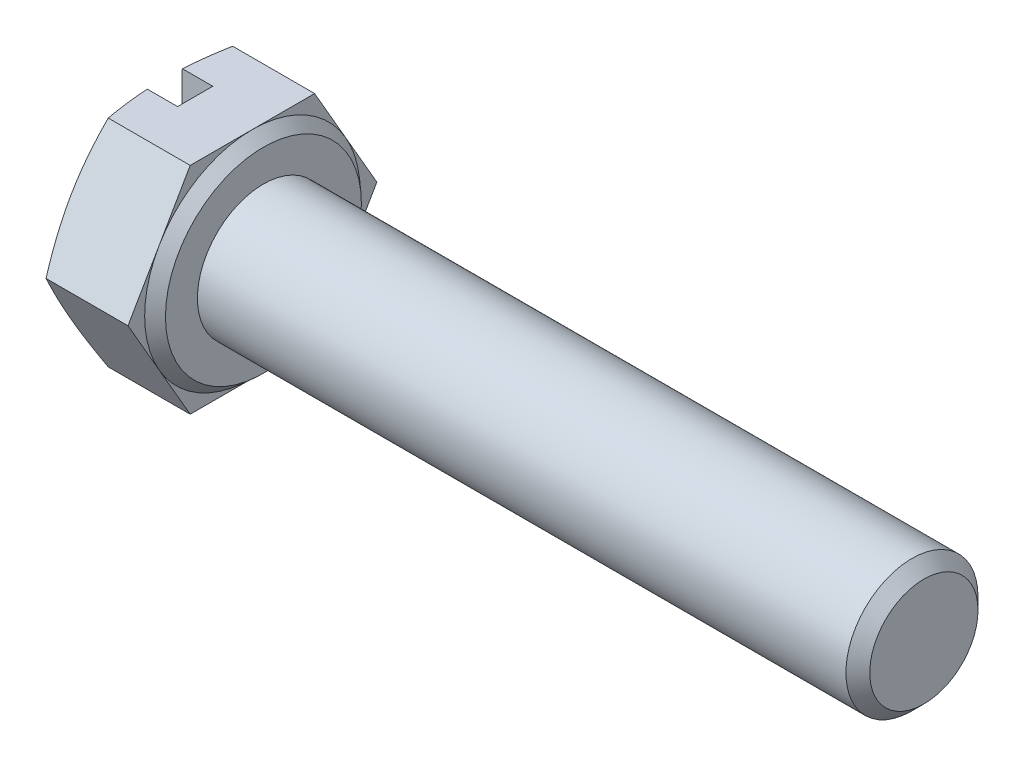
ISO-10303-21;
HEADER;
FILE_DESCRIPTION(('STEP AP214'),'2;1');
FILE_NAME('part.step','',(''),(''),'','','');
FILE_SCHEMA(('AUTOMOTIVE_DESIGN { 1 0 10303 214 1 1 1 1 }'));
ENDSEC;
DATA;
#1=APPLICATION_CONTEXT('core data for automotive mechanical design processes');
#2=APPLICATION_PROTOCOL_DEFINITION('international standard','automotive_design',2000,#1);
#3=PRODUCT_CONTEXT('',#1,'mechanical');
#4=PRODUCT('Part','Part','',(#3));
#5=PRODUCT_RELATED_PRODUCT_CATEGORY('part','',(#4));
#6=PRODUCT_DEFINITION_FORMATION('','',#4);
#7=PRODUCT_DEFINITION_CONTEXT('part definition',#1,'design');
#8=PRODUCT_DEFINITION('design','',#6,#7);
#9=PRODUCT_DEFINITION_SHAPE('','',#8);
#10=(LENGTH_UNIT() NAMED_UNIT(*) SI_UNIT(.MILLI.,.METRE.));
#11=(NAMED_UNIT(*) PLANE_ANGLE_UNIT() SI_UNIT($,.RADIAN.));
#12=(NAMED_UNIT(*) SI_UNIT($,.STERADIAN.) SOLID_ANGLE_UNIT());
#13=UNCERTAINTY_MEASURE_WITH_UNIT(LENGTH_MEASURE(1.E-05),#10,'distance_accuracy_value','');
#14=(GEOMETRIC_REPRESENTATION_CONTEXT(3) GLOBAL_UNCERTAINTY_ASSIGNED_CONTEXT((#13)) GLOBAL_UNIT_ASSIGNED_CONTEXT((#10,
#11,#12)) REPRESENTATION_CONTEXT('',''));
#15=CARTESIAN_POINT('',(0.,0.,0.));
#16=DIRECTION('',(0.,0.,1.));
#17=DIRECTION('',(1.,0.,0.));
#18=AXIS2_PLACEMENT_3D('',#15,#16,#17);
#19=CARTESIAN_POINT('',(0.,-4.89499999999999,-2.82612956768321));
#20=DIRECTION('',(1.,0.,0.));
#21=DIRECTION('',(0.,0.,-1.));
#22=AXIS2_PLACEMENT_3D('',#19,#20,#21);
#23=PLANE('',#22);
#24=CARTESIAN_POINT('',(0.,0.,0.));
#25=DIRECTION('',(1.,0.,0.));
#26=DIRECTION('',(0.,0.,-1.));
#27=AXIS2_PLACEMENT_3D('',#24,#25,#26);
#28=CIRCLE('',#27,4.895);
#29=CARTESIAN_POINT('',(0.,-4.82918471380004,-0.8));
#30=VERTEX_POINT('',#29);
#31=CARTESIAN_POINT('',(0.,-2.44749999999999,-4.23919435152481));
#32=VERTEX_POINT('',#31);
#33=EDGE_CURVE('E310',#30,#32,#28,.T.);
#34=ORIENTED_EDGE('',*,*,#33,.F.);
#35=DIRECTION('',(0.,1.,0.));
#36=VECTOR('',#35,1.);
#37=CARTESIAN_POINT('',(0.,-4.89499999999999,-0.799999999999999));
#38=LINE('',#37,#36);
#39=CARTESIAN_POINT('',(0.,4.82918471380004,-0.8));
#40=VERTEX_POINT('',#39);
#41=EDGE_CURVE('E11',#30,#40,#38,.T.);
#42=ORIENTED_EDGE('',*,*,#41,.T.);
#43=CARTESIAN_POINT('',(0.,2.4475,-4.23919435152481));
#44=VERTEX_POINT('',#43);
#45=EDGE_CURVE('E308',#44,#40,#28,.T.);
#46=ORIENTED_EDGE('',*,*,#45,.F.);
#47=EDGE_CURVE('E316',#32,#44,#28,.T.);
#48=ORIENTED_EDGE('',*,*,#47,.F.);
#49=EDGE_LOOP('',(#34,#42,#46,#48));
#50=FACE_BOUND('',#49,.T.);
#51=ADVANCED_FACE('F35',(#50),#23,.F.);
#52=CARTESIAN_POINT('',(4.,-4.89499999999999,2.82612956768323));
#53=DIRECTION('',(0.,1.,0.));
#54=DIRECTION('',(0.,0.,1.));
#55=AXIS2_PLACEMENT_3D('',#52,#53,#54);
#56=PLANE('',#55);
#57=DIRECTION('',(0.,0.,-1.));
#58=VECTOR('',#57,1.);
#59=CARTESIAN_POINT('',(1.4,-4.89500000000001,0.8));
#60=LINE('',#59,#58);
#61=CARTESIAN_POINT('',(1.4,-4.89500000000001,0.8));
#62=VERTEX_POINT('',#61);
#63=CARTESIAN_POINT('',(1.4,-4.89500000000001,-0.8));
#64=VERTEX_POINT('',#63);
#65=EDGE_CURVE('E172',#62,#64,#60,.T.);
#66=ORIENTED_EDGE('',*,*,#65,.T.);
#67=DIRECTION('',(-1.,0.,0.));
#68=VECTOR('',#67,1.);
#69=CARTESIAN_POINT('',(1.4,-4.89500000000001,-0.8));
#70=LINE('',#69,#68);
#71=CARTESIAN_POINT('',(0.0236369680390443,-4.89500000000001,-0.8));
#72=VERTEX_POINT('',#71);
#73=EDGE_CURVE('E178',#64,#72,#70,.T.);
#74=ORIENTED_EDGE('',*,*,#73,.T.);
#75=CARTESIAN_POINT('',(1.47280282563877,-4.89499999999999,-7.48259735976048));
#76=CARTESIAN_POINT('',(1.4053660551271,-4.89499999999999,-7.26112985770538));
#77=CARTESIAN_POINT('',(1.33871618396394,-4.89499999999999,-7.03941829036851));
#78=CARTESIAN_POINT('',(1.20742555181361,-4.89499999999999,-6.59538277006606));
#79=CARTESIAN_POINT('',(1.14278494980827,-4.89499999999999,-6.37305877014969));
#80=CARTESIAN_POINT('',(1.01584063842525,-4.89499999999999,-5.92729359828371));
#81=CARTESIAN_POINT('',(0.953541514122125,-4.89499999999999,-5.70385111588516));
#82=CARTESIAN_POINT('',(0.83200951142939,-4.89499999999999,-5.25613497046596));
#83=CARTESIAN_POINT('',(0.772776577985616,-4.89499999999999,-5.03186132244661));
#84=CARTESIAN_POINT('',(0.65884143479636,-4.89499999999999,-4.58509839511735));
#85=CARTESIAN_POINT('',(0.604092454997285,-4.89499999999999,-4.36262110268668));
#86=CARTESIAN_POINT('',(0.499258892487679,-4.89499999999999,-3.91657221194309));
#87=CARTESIAN_POINT('',(0.449174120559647,-4.89499999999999,-3.69300065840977));
#88=CARTESIAN_POINT('',(0.354831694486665,-4.89499999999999,-3.24469411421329));
#89=CARTESIAN_POINT('',(0.310572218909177,-4.89499999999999,-3.01995951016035));
#90=CARTESIAN_POINT('',(0.229229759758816,-4.89499999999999,-2.56918556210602));
#91=CARTESIAN_POINT('',(0.192146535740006,-4.89499999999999,-2.34314626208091));
#92=CARTESIAN_POINT('',(0.130334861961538,-4.89499999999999,-1.91521583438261));
#93=CARTESIAN_POINT('',(0.104687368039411,-4.89499999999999,-1.7134587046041));
#94=CARTESIAN_POINT('',(0.0612722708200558,-4.89499999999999,-1.30909131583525));
#95=CARTESIAN_POINT('',(0.0435044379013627,-4.89499999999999,-1.10648108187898));
#96=CARTESIAN_POINT('',(0.0167043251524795,-4.89499999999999,-0.700818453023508));
#97=CARTESIAN_POINT('',(0.00766586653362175,-4.89499999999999,-0.497766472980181));
#98=CARTESIAN_POINT('',(-0.0012178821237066,-4.89499999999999,-0.0914593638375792));
#99=CARTESIAN_POINT('',(-0.00106323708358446,-4.89499999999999,0.111795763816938));
#100=CARTESIAN_POINT('',(0.00845489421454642,-4.89499999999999,0.519118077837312));
#101=CARTESIAN_POINT('',(0.0178650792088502,-4.89499999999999,0.723184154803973));
#102=CARTESIAN_POINT('',(0.045461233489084,-4.89499999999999,1.13071691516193));
#103=CARTESIAN_POINT('',(0.0636474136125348,-4.89499999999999,1.33418358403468));
#104=CARTESIAN_POINT('',(0.107944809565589,-4.89499999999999,1.74041706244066));
#105=CARTESIAN_POINT('',(0.134062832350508,-4.89499999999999,1.94318311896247));
#106=CARTESIAN_POINT('',(0.193164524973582,-4.89499999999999,2.34770083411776));
#107=CARTESIAN_POINT('',(0.226148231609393,-4.89499999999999,2.54945248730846));
#108=CARTESIAN_POINT('',(0.299805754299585,-4.89499999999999,2.96255825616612));
#109=CARTESIAN_POINT('',(0.340794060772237,-4.89499999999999,3.17385579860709));
#110=CARTESIAN_POINT('',(0.428046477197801,-4.89499999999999,3.59536569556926));
#111=CARTESIAN_POINT('',(0.474310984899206,-4.89499999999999,3.80557796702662));
#112=CARTESIAN_POINT('',(0.571141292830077,-4.89499999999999,4.22506166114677));
#113=CARTESIAN_POINT('',(0.621708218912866,-4.89499999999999,4.43433282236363));
#114=CARTESIAN_POINT('',(0.726331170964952,-4.89499999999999,4.85200390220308));
#115=CARTESIAN_POINT('',(0.780387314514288,-4.89499999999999,5.06040379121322));
#116=CARTESIAN_POINT('',(0.946912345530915,-4.89499999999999,5.68499348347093));
#117=CARTESIAN_POINT('',(1.06361407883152,-4.89499999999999,6.10005298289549));
#118=CARTESIAN_POINT('',(1.30450839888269,-4.89499999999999,6.92789191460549));
#119=CARTESIAN_POINT('',(1.42869979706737,-4.89499999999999,7.34067169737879));
#120=CARTESIAN_POINT('',(1.68088123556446,-4.89499999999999,8.16007873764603));
#121=CARTESIAN_POINT('',(1.8088142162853,-4.89499999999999,8.56672361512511));
#122=CARTESIAN_POINT('',(2.06831294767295,-4.89499999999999,9.37886971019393));
#123=CARTESIAN_POINT('',(2.19987887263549,-4.89499999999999,9.78437087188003));
#124=CARTESIAN_POINT('',(2.46515556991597,-4.89499999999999,10.5929650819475));
#125=CARTESIAN_POINT('',(2.59885630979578,-4.89499999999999,10.9960614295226));
#126=CARTESIAN_POINT('',(2.86826241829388,-4.89499999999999,11.8015473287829));
#127=CARTESIAN_POINT('',(3.00396762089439,-4.89499999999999,12.2039369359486));
#128=CARTESIAN_POINT('',(3.14037395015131,-4.89499999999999,12.6060852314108));
#129=B_SPLINE_CURVE_WITH_KNOTS('',3,(#75,#76,#77,#78,#79,#80,#81,#82,#83,#84,#85,#86,#87,#88,
#89,#90,#91,#92,#93,#94,#95,#96,#97,#98,#99,#100,#101,#102,#103,#104,#105,#106,#107,#108,#109,
#110,#111,#112,#113,#114,#115,#116,#117,#118,#119,#120,#121,#122,#123,#124,#125,#126,#127,#128),
.UNSPECIFIED.,.F.,.F.,(4,2,2,2,2,2,2,2,2,2,2,2,2,2,2,2,2,2,2,2,2,2,2,2,2,2,4),(0.,
0.694526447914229,1.38910771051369,2.08498488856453,2.78084956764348,3.46815431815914,
4.15543117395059,4.84249262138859,5.52953104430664,6.1395393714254,6.74952992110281,
7.35908839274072,7.9686425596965,8.58128808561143,9.19394833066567,9.8071358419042,
10.4203266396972,11.0659531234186,11.7116283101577,12.3574729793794,13.0033394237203,
14.2966762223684,15.5898083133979,16.8686670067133,18.1475871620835,19.4216546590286,
20.6956172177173),.UNSPECIFIED.);
#130=CARTESIAN_POINT('',(0.275619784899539,-4.89499999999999,-2.82612956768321));
#131=VERTEX_POINT('',#130);
#132=EDGE_CURVE('E388',#131,#72,#129,.T.);
#133=ORIENTED_EDGE('',*,*,#132,.F.);
#134=DIRECTION('',(-1.,0.,0.));
#135=VECTOR('',#134,1.);
#136=CARTESIAN_POINT('',(4.,-4.89499999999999,-2.82612956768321));
#137=LINE('',#136,#135);
#138=CARTESIAN_POINT('',(4.,-4.89499999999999,-2.82612956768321));
#139=VERTEX_POINT('',#138);
#140=EDGE_CURVE('E330',#139,#131,#137,.T.);
#141=ORIENTED_EDGE('',*,*,#140,.F.);
#142=DIRECTION('',(0.,0.,-1.));
#143=VECTOR('',#142,1.);
#144=CARTESIAN_POINT('',(4.,-4.89499999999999,2.82612956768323));
#145=LINE('',#144,#143);
#146=CARTESIAN_POINT('',(4.,-4.89499999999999,0.));
#147=VERTEX_POINT('',#146);
#148=EDGE_CURVE('E371',#147,#139,#145,.T.);
#149=ORIENTED_EDGE('',*,*,#148,.F.);
#150=CARTESIAN_POINT('',(4.,-4.89499999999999,2.82612956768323));
#151=VERTEX_POINT('',#150);
#152=EDGE_CURVE('E368',#151,#147,#145,.T.);
#153=ORIENTED_EDGE('',*,*,#152,.F.);
#154=DIRECTION('',(-1.,0.,0.));
#155=VECTOR('',#154,1.);
#156=CARTESIAN_POINT('',(4.,-4.89499999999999,2.82612956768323));
#157=LINE('',#156,#155);
#158=CARTESIAN_POINT('',(0.275619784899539,-4.89500000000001,2.82612956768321));
#159=VERTEX_POINT('',#158);
#160=EDGE_CURVE('E346',#151,#159,#157,.T.);
#161=ORIENTED_EDGE('',*,*,#160,.T.);
#162=CARTESIAN_POINT('',(0.0236369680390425,-4.89500000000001,0.8));
#163=VERTEX_POINT('',#162);
#164=EDGE_CURVE('E264',#163,#159,#129,.T.);
#165=ORIENTED_EDGE('',*,*,#164,.F.);
#166=DIRECTION('',(1.,0.,0.));
#167=VECTOR('',#166,1.);
#168=CARTESIAN_POINT('',(0.,-4.89500000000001,0.8));
#169=LINE('',#168,#167);
#170=EDGE_CURVE('E181',#163,#62,#169,.T.);
#171=ORIENTED_EDGE('',*,*,#170,.T.);
#172=EDGE_LOOP('',(#66,#74,#133,#141,#149,#153,#161,#165,#171));
#173=FACE_BOUND('',#172,.T.);
#174=ADVANCED_FACE('F281',(#173),#56,.F.);
#175=CARTESIAN_POINT('',(4.,-4.89499999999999,-2.82612956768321));
#176=DIRECTION('',(0.,0.499999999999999,0.866025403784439));
#177=DIRECTION('',(0.,-0.866025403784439,0.499999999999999));
#178=AXIS2_PLACEMENT_3D('',#175,#176,#177);
#179=PLANE('',#178);
#180=CARTESIAN_POINT('',(0.275661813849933,0.000200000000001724,-5.65237460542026));
#181=CARTESIAN_POINT('',(0.233044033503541,-0.20252917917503,-5.53532885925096));
#182=CARTESIAN_POINT('',(0.194275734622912,-0.405926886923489,-5.41789713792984));
#183=CARTESIAN_POINT('',(0.126068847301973,-0.814044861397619,-5.18227011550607));
#184=CARTESIAN_POINT('',(0.096637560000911,-1.01876603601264,-5.06407429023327));
#185=CARTESIAN_POINT('',(0.0490332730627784,-1.42725892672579,-4.82823080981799));
#186=CARTESIAN_POINT('',(0.0307564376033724,-1.63102131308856,-4.71058854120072));
#187=CARTESIAN_POINT('',(0.00624205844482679,-2.03902260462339,-4.47502888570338));
#188=CARTESIAN_POINT('',(0.,-2.24326130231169,-4.3571116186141));
#189=CARTESIAN_POINT('',(0.,-2.6517386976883,-4.12127708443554));
#190=CARTESIAN_POINT('',(0.00624205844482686,-2.8559773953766,-4.00335981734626));
#191=CARTESIAN_POINT('',(0.0307564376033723,-3.26397868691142,-3.76780016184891));
#192=CARTESIAN_POINT('',(0.049033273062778,-3.4677410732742,-3.65015789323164));
#193=CARTESIAN_POINT('',(0.0966375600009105,-3.87623396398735,-3.41431441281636));
#194=CARTESIAN_POINT('',(0.126068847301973,-4.08095513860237,-3.29611858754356));
#195=CARTESIAN_POINT('',(0.194275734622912,-4.4890731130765,-3.0604915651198));
#196=CARTESIAN_POINT('',(0.233044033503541,-4.69247082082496,-2.94305984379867));
#197=CARTESIAN_POINT('',(0.275661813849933,-4.89519999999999,-2.82601409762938));
#198=B_SPLINE_CURVE_WITH_KNOTS('',3,(#180,#181,#182,#183,#184,#185,#186,#187,#188,#189,#190,
#191,#192,#193,#194,#195,#196,#197),.UNSPECIFIED.,.F.,.F.,(4,2,2,2,2,2,2,2,4),(0.,
0.713891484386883,1.42833983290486,2.13603175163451,2.84345813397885,3.55088451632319,
4.25857643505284,4.97302478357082,5.68691626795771),.UNSPECIFIED.);
#199=CARTESIAN_POINT('',(0.275619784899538,0.,-5.65225913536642));
#200=VERTEX_POINT('',#199);
#201=EDGE_CURVE('E272',#200,#32,#198,.T.);
#202=ORIENTED_EDGE('',*,*,#201,.F.);
#203=DIRECTION('',(-1.,0.,0.));
#204=VECTOR('',#203,1.);
#205=CARTESIAN_POINT('',(4.,0.,-5.65225913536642));
#206=LINE('',#205,#204);
#207=CARTESIAN_POINT('',(4.,0.,-5.65225913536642));
#208=VERTEX_POINT('',#207);
#209=EDGE_CURVE('E334',#208,#200,#206,.T.);
#210=ORIENTED_EDGE('',*,*,#209,.F.);
#211=DIRECTION('',(0.,0.866025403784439,-0.499999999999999));
#212=VECTOR('',#211,1.);
#213=CARTESIAN_POINT('',(4.,-4.89499999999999,-2.82612956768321));
#214=LINE('',#213,#212);
#215=CARTESIAN_POINT('',(4.,-2.44749999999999,-4.2391943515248));
#216=VERTEX_POINT('',#215);
#217=EDGE_CURVE('E367',#216,#208,#214,.T.);
#218=ORIENTED_EDGE('',*,*,#217,.F.);
#219=EDGE_CURVE('E364',#139,#216,#214,.T.);
#220=ORIENTED_EDGE('',*,*,#219,.F.);
#221=ORIENTED_EDGE('',*,*,#140,.T.);
#222=EDGE_CURVE('E261',#32,#131,#198,.T.);
#223=ORIENTED_EDGE('',*,*,#222,.F.);
#224=EDGE_LOOP('',(#202,#210,#218,#220,#221,#223));
#225=FACE_BOUND('',#224,.T.);
#226=ADVANCED_FACE('F278',(#225),#179,.F.);
#227=CARTESIAN_POINT('',(4.,0.,-5.65225913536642));
#228=DIRECTION('',(0.,-0.5,0.866025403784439));
#229=DIRECTION('',(0.,-0.866025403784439,-0.5));
#230=AXIS2_PLACEMENT_3D('',#227,#228,#229);
#231=PLANE('',#230);
#232=CARTESIAN_POINT('',(0.275661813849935,4.8952,-2.82601409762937));
#233=CARTESIAN_POINT('',(0.233044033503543,4.69247082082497,-2.94305984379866));
#234=CARTESIAN_POINT('',(0.194275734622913,4.48907311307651,-3.06049156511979));
#235=CARTESIAN_POINT('',(0.126068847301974,4.08095513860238,-3.29611858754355));
#236=CARTESIAN_POINT('',(0.0966375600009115,3.87623396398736,-3.41431441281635));
#237=CARTESIAN_POINT('',(0.0490332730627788,3.46774107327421,-3.65015789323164));
#238=CARTESIAN_POINT('',(0.0307564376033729,3.26397868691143,-3.7678001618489));
#239=CARTESIAN_POINT('',(0.00624205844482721,2.85597739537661,-4.00335981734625));
#240=CARTESIAN_POINT('',(0.,2.65173869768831,-4.12127708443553));
#241=CARTESIAN_POINT('',(0.,2.2432613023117,-4.35711161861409));
#242=CARTESIAN_POINT('',(0.0062420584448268,2.0390226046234,-4.47502888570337));
#243=CARTESIAN_POINT('',(0.0307564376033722,1.63102131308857,-4.71058854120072));
#244=CARTESIAN_POINT('',(0.0490332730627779,1.4272589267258,-4.82823080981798));
#245=CARTESIAN_POINT('',(0.0966375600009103,1.01876603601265,-5.06407429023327));
#246=CARTESIAN_POINT('',(0.126068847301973,0.814044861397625,-5.18227011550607));
#247=CARTESIAN_POINT('',(0.194275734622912,0.405926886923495,-5.41789713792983));
#248=CARTESIAN_POINT('',(0.233044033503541,0.202529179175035,-5.53532885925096));
#249=CARTESIAN_POINT('',(0.275661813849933,-0.000199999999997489,-5.65237460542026));
#250=B_SPLINE_CURVE_WITH_KNOTS('',3,(#232,#233,#234,#235,#236,#237,#238,#239,#240,#241,#242,
#243,#244,#245,#246,#247,#248,#249),.UNSPECIFIED.,.F.,.F.,(4,2,2,2,2,2,2,2,4),(0.,
0.713891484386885,1.42833983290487,2.13603175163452,2.84345813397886,3.5508845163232,
4.25857643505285,4.97302478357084,5.68691626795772),.UNSPECIFIED.);
#251=CARTESIAN_POINT('',(0.275619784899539,4.895,-2.82612956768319));
#252=VERTEX_POINT('',#251);
#253=EDGE_CURVE('E312',#252,#44,#250,.T.);
#254=ORIENTED_EDGE('',*,*,#253,.F.);
#255=DIRECTION('',(-1.,0.,0.));
#256=VECTOR('',#255,1.);
#257=CARTESIAN_POINT('',(4.,4.895,-2.8261295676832));
#258=LINE('',#257,#256);
#259=CARTESIAN_POINT('',(4.,4.895,-2.8261295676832));
#260=VERTEX_POINT('',#259);
#261=EDGE_CURVE('E337',#260,#252,#258,.T.);
#262=ORIENTED_EDGE('',*,*,#261,.F.);
#263=DIRECTION('',(0.,0.866025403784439,0.5));
#264=VECTOR('',#263,1.);
#265=CARTESIAN_POINT('',(4.,0.,-5.65225913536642));
#266=LINE('',#265,#264);
#267=CARTESIAN_POINT('',(4.,2.44749999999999,-4.2391943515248));
#268=VERTEX_POINT('',#267);
#269=EDGE_CURVE('E363',#268,#260,#266,.T.);
#270=ORIENTED_EDGE('',*,*,#269,.F.);
#271=EDGE_CURVE('E360',#208,#268,#266,.T.);
#272=ORIENTED_EDGE('',*,*,#271,.F.);
#273=ORIENTED_EDGE('',*,*,#209,.T.);
#274=EDGE_CURVE('E273',#44,#200,#250,.T.);
#275=ORIENTED_EDGE('',*,*,#274,.F.);
#276=EDGE_LOOP('',(#254,#262,#270,#272,#273,#275));
#277=FACE_BOUND('',#276,.T.);
#278=ADVANCED_FACE('F252',(#277),#231,.F.);
#279=CARTESIAN_POINT('',(4.,4.895,-2.8261295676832));
#280=DIRECTION('',(0.,-1.,0.));
#281=DIRECTION('',(0.,0.,-1.));
#282=AXIS2_PLACEMENT_3D('',#279,#280,#281);
#283=PLANE('',#282);
#284=CARTESIAN_POINT('',(1.47280282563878,4.895,-7.48259735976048));
#285=CARTESIAN_POINT('',(1.40536605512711,4.895,-7.26112985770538));
#286=CARTESIAN_POINT('',(1.33871618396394,4.895,-7.03941829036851));
#287=CARTESIAN_POINT('',(1.20742555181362,4.895,-6.59538277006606));
#288=CARTESIAN_POINT('',(1.14278494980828,4.895,-6.37305877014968));
#289=CARTESIAN_POINT('',(1.01584063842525,4.895,-5.9272935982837));
#290=CARTESIAN_POINT('',(0.953541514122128,4.895,-5.70385111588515));
#291=CARTESIAN_POINT('',(0.832009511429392,4.895,-5.25613497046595));
#292=CARTESIAN_POINT('',(0.772776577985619,4.895,-5.03186132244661));
#293=CARTESIAN_POINT('',(0.658841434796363,4.895,-4.58509839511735));
#294=CARTESIAN_POINT('',(0.604092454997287,4.895,-4.36262110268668));
#295=CARTESIAN_POINT('',(0.499258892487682,4.895,-3.91657221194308));
#296=CARTESIAN_POINT('',(0.44917412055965,4.895,-3.69300065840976));
#297=CARTESIAN_POINT('',(0.354831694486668,4.895,-3.24469411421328));
#298=CARTESIAN_POINT('',(0.31057221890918,4.895,-3.01995951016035));
#299=CARTESIAN_POINT('',(0.229229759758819,4.895,-2.56918556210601));
#300=CARTESIAN_POINT('',(0.19214653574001,4.895,-2.3431462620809));
#301=CARTESIAN_POINT('',(0.130334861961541,4.895,-1.9152158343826));
#302=CARTESIAN_POINT('',(0.104687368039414,4.895,-1.71345870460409));
#303=CARTESIAN_POINT('',(0.0612722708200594,4.895,-1.30909131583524));
#304=CARTESIAN_POINT('',(0.0435044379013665,4.895,-1.10648108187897));
#305=CARTESIAN_POINT('',(0.016704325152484,4.895,-0.700818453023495));
#306=CARTESIAN_POINT('',(0.0076658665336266,4.895,-0.497766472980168));
#307=CARTESIAN_POINT('',(-0.00121788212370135,4.895,-0.0914593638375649));
#308=CARTESIAN_POINT('',(-0.00106323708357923,4.895,0.111795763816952));
#309=CARTESIAN_POINT('',(0.00845489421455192,4.895,0.519118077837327));
#310=CARTESIAN_POINT('',(0.017865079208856,4.895,0.723184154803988));
#311=CARTESIAN_POINT('',(0.0454612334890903,4.895,1.13071691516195));
#312=CARTESIAN_POINT('',(0.0636474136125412,4.895,1.3341835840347));
#313=CARTESIAN_POINT('',(0.107944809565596,4.895,1.74041706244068));
#314=CARTESIAN_POINT('',(0.134062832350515,4.895,1.94318311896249));
#315=CARTESIAN_POINT('',(0.193164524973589,4.895,2.34770083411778));
#316=CARTESIAN_POINT('',(0.226148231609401,4.895,2.54945248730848));
#317=CARTESIAN_POINT('',(0.299805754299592,4.895,2.96255825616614));
#318=CARTESIAN_POINT('',(0.340794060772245,4.895,3.1738557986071));
#319=CARTESIAN_POINT('',(0.428046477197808,4.895,3.59536569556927));
#320=CARTESIAN_POINT('',(0.474310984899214,4.895,3.80557796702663));
#321=CARTESIAN_POINT('',(0.571141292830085,4.895,4.22506166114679));
#322=CARTESIAN_POINT('',(0.621708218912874,4.895,4.43433282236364));
#323=CARTESIAN_POINT('',(0.726331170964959,4.895,4.8520039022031));
#324=CARTESIAN_POINT('',(0.780387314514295,4.895,5.06040379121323));
#325=CARTESIAN_POINT('',(0.946912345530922,4.895,5.68499348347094));
#326=CARTESIAN_POINT('',(1.06361407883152,4.895,6.1000529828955));
#327=CARTESIAN_POINT('',(1.3045083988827,4.895,6.9278919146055));
#328=CARTESIAN_POINT('',(1.42869979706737,4.895,7.3406716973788));
#329=CARTESIAN_POINT('',(1.68088123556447,4.895,8.16007873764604));
#330=CARTESIAN_POINT('',(1.80881421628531,4.895,8.56672361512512));
#331=CARTESIAN_POINT('',(2.06831294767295,4.895,9.37886971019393));
#332=CARTESIAN_POINT('',(2.19987887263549,4.895,9.78437087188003));
#333=CARTESIAN_POINT('',(2.46515556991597,4.895,10.5929650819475));
#334=CARTESIAN_POINT('',(2.59885630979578,4.895,10.9960614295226));
#335=CARTESIAN_POINT('',(2.86826241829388,4.895,11.8015473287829));
#336=CARTESIAN_POINT('',(3.00396762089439,4.895,12.2039369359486));
#337=CARTESIAN_POINT('',(3.14037395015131,4.895,12.6060852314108));
#338=B_SPLINE_CURVE_WITH_KNOTS('',3,(#284,#285,#286,#287,#288,#289,#290,#291,#292,#293,#294,
#295,#296,#297,#298,#299,#300,#301,#302,#303,#304,#305,#306,#307,#308,#309,#310,#311,#312,#313,
#314,#315,#316,#317,#318,#319,#320,#321,#322,#323,#324,#325,#326,#327,#328,#329,#330,#331,#332,
#333,#334,#335,#336,#337),.UNSPECIFIED.,.F.,.F.,(4,2,2,2,2,2,2,2,2,2,2,2,2,2,2,2,2,2,2,2,2,2,2,
2,2,2,4),(0.,0.694526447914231,1.38910771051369,2.08498488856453,2.78084956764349,
3.46815431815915,4.15543117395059,4.84249262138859,5.52953104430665,6.13953937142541,
6.74952992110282,7.35908839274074,7.96864255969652,8.58128808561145,9.19394833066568,
9.80713584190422,10.4203266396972,11.0659531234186,11.7116283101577,12.3574729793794,
13.0033394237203,14.2966762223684,15.5898083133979,16.8686670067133,18.1475871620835,
19.4216546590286,20.6956172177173),.UNSPECIFIED.);
#339=CARTESIAN_POINT('',(0.0236369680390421,4.895,-0.8));
#340=VERTEX_POINT('',#339);
#341=EDGE_CURVE('E263',#340,#252,#338,.F.);
#342=ORIENTED_EDGE('',*,*,#341,.F.);
#343=DIRECTION('',(-1.,0.,0.));
#344=VECTOR('',#343,1.);
#345=CARTESIAN_POINT('',(1.4,4.895,-0.8));
#346=LINE('',#345,#344);
#347=CARTESIAN_POINT('',(1.4,4.895,-0.8));
#348=VERTEX_POINT('',#347);
#349=EDGE_CURVE('E165',#348,#340,#346,.T.);
#350=ORIENTED_EDGE('',*,*,#349,.F.);
#351=DIRECTION('',(0.,0.,-1.));
#352=VECTOR('',#351,1.);
#353=CARTESIAN_POINT('',(1.4,4.895,0.8));
#354=LINE('',#353,#352);
#355=CARTESIAN_POINT('',(1.4,4.895,0.8));
#356=VERTEX_POINT('',#355);
#357=EDGE_CURVE('E164',#356,#348,#354,.T.);
#358=ORIENTED_EDGE('',*,*,#357,.F.);
#359=DIRECTION('',(1.,0.,0.));
#360=VECTOR('',#359,1.);
#361=CARTESIAN_POINT('',(0.,4.895,0.8));
#362=LINE('',#361,#360);
#363=CARTESIAN_POINT('',(0.0236369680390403,4.895,0.8));
#364=VERTEX_POINT('',#363);
#365=EDGE_CURVE('E153',#364,#356,#362,.T.);
#366=ORIENTED_EDGE('',*,*,#365,.F.);
#367=CARTESIAN_POINT('',(0.275619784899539,4.895,2.82612956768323));
#368=VERTEX_POINT('',#367);
#369=EDGE_CURVE('E256',#368,#364,#338,.F.);
#370=ORIENTED_EDGE('',*,*,#369,.F.);
#371=DIRECTION('',(-1.,0.,0.));
#372=VECTOR('',#371,1.);
#373=CARTESIAN_POINT('',(4.,4.895,2.82612956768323));
#374=LINE('',#373,#372);
#375=CARTESIAN_POINT('',(4.,4.895,2.82612956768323));
#376=VERTEX_POINT('',#375);
#377=EDGE_CURVE('E340',#376,#368,#374,.T.);
#378=ORIENTED_EDGE('',*,*,#377,.F.);
#379=DIRECTION('',(0.,0.,1.));
#380=VECTOR('',#379,1.);
#381=CARTESIAN_POINT('',(4.,4.895,-2.8261295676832));
#382=LINE('',#381,#380);
#383=CARTESIAN_POINT('',(4.,4.89499999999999,0.));
#384=VERTEX_POINT('',#383);
#385=EDGE_CURVE('E359',#384,#376,#382,.T.);
#386=ORIENTED_EDGE('',*,*,#385,.F.);
#387=EDGE_CURVE('E356',#260,#384,#382,.T.);
#388=ORIENTED_EDGE('',*,*,#387,.F.);
#389=ORIENTED_EDGE('',*,*,#261,.T.);
#390=EDGE_LOOP('',(#342,#350,#358,#366,#370,#378,#386,#388,#389));
#391=FACE_BOUND('',#390,.T.);
#392=ADVANCED_FACE('F177',(#391),#283,.F.);
#393=CARTESIAN_POINT('',(4.,4.895,2.82612956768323));
#394=DIRECTION('',(0.,-0.499999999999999,-0.866025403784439));
#395=DIRECTION('',(0.,0.866025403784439,-0.499999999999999));
#396=AXIS2_PLACEMENT_3D('',#393,#394,#395);
#397=PLANE('',#396);
#398=CARTESIAN_POINT('',(0.27566181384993,-0.000199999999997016,5.65237460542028));
#399=CARTESIAN_POINT('',(0.233044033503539,0.202529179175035,5.53532885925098));
#400=CARTESIAN_POINT('',(0.194275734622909,0.405926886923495,5.41789713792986));
#401=CARTESIAN_POINT('',(0.12606884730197,0.814044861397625,5.18227011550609));
#402=CARTESIAN_POINT('',(0.0966375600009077,1.01876603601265,5.06407429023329));
#403=CARTESIAN_POINT('',(0.0490332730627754,1.4272589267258,4.82823080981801));
#404=CARTESIAN_POINT('',(0.0307564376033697,1.63102131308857,4.71058854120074));
#405=CARTESIAN_POINT('',(0.00624205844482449,2.03902260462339,4.4750288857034));
#406=CARTESIAN_POINT('',(0.,2.2432613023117,4.35711161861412));
#407=CARTESIAN_POINT('',(0.,2.65173869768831,4.12127708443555));
#408=CARTESIAN_POINT('',(0.00624205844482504,2.85597739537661,4.00335981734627));
#409=CARTESIAN_POINT('',(0.0307564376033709,3.26397868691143,3.76780016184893));
#410=CARTESIAN_POINT('',(0.049033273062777,3.46774107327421,3.65015789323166));
#411=CARTESIAN_POINT('',(0.09663756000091,3.87623396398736,3.41431441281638));
#412=CARTESIAN_POINT('',(0.126068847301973,4.08095513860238,3.29611858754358));
#413=CARTESIAN_POINT('',(0.194275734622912,4.48907311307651,3.06049156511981));
#414=CARTESIAN_POINT('',(0.233044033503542,4.69247082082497,2.94305984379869));
#415=CARTESIAN_POINT('',(0.275661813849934,4.8952,2.82601409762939));
#416=B_SPLINE_CURVE_WITH_KNOTS('',3,(#398,#399,#400,#401,#402,#403,#404,#405,#406,#407,#408,
#409,#410,#411,#412,#413,#414,#415),.UNSPECIFIED.,.F.,.F.,(4,2,2,2,2,2,2,2,4),(0.,
0.713891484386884,1.42833983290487,2.13603175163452,2.84345813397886,3.5508845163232,
4.25857643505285,4.97302478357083,5.68691626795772),.UNSPECIFIED.);
#417=CARTESIAN_POINT('',(0.27561978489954,0.,5.65225913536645));
#418=VERTEX_POINT('',#417);
#419=CARTESIAN_POINT('',(0.,2.4475,4.23919435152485));
#420=VERTEX_POINT('',#419);
#421=EDGE_CURVE('E58',#418,#420,#416,.T.);
#422=ORIENTED_EDGE('',*,*,#421,.F.);
#423=DIRECTION('',(-1.,0.,0.));
#424=VECTOR('',#423,1.);
#425=CARTESIAN_POINT('',(4.,0.,5.65225913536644));
#426=LINE('',#425,#424);
#427=CARTESIAN_POINT('',(4.,0.,5.65225913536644));
#428=VERTEX_POINT('',#427);
#429=EDGE_CURVE('E343',#428,#418,#426,.T.);
#430=ORIENTED_EDGE('',*,*,#429,.F.);
#431=DIRECTION('',(0.,-0.866025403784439,0.499999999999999));
#432=VECTOR('',#431,1.);
#433=CARTESIAN_POINT('',(4.,4.895,2.82612956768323));
#434=LINE('',#433,#432);
#435=CARTESIAN_POINT('',(4.,2.44749999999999,4.23919435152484));
#436=VERTEX_POINT('',#435);
#437=EDGE_CURVE('E355',#436,#428,#434,.T.);
#438=ORIENTED_EDGE('',*,*,#437,.F.);
#439=EDGE_CURVE('E352',#376,#436,#434,.T.);
#440=ORIENTED_EDGE('',*,*,#439,.F.);
#441=ORIENTED_EDGE('',*,*,#377,.T.);
#442=EDGE_CURVE('E262',#420,#368,#416,.T.);
#443=ORIENTED_EDGE('',*,*,#442,.F.);
#444=EDGE_LOOP('',(#422,#430,#438,#440,#441,#443));
#445=FACE_BOUND('',#444,.T.);
#446=ADVANCED_FACE('F242',(#445),#397,.F.);
#447=CARTESIAN_POINT('',(4.,0.,5.65225913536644));
#448=DIRECTION('',(0.,0.5,-0.866025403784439));
#449=DIRECTION('',(0.,0.866025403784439,0.5));
#450=AXIS2_PLACEMENT_3D('',#447,#448,#449);
#451=PLANE('',#450);
#452=CARTESIAN_POINT('',(0.27566181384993,-4.89519999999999,2.82601409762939));
#453=CARTESIAN_POINT('',(0.233044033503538,-4.69247082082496,2.94305984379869));
#454=CARTESIAN_POINT('',(0.194275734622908,-4.4890731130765,3.06049156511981));
#455=CARTESIAN_POINT('',(0.126068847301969,-4.08095513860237,3.29611858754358));
#456=CARTESIAN_POINT('',(0.0966375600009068,-3.87623396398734,3.41431441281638));
#457=CARTESIAN_POINT('',(0.0490332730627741,-3.4677410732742,3.65015789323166));
#458=CARTESIAN_POINT('',(0.0307564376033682,-3.26397868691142,3.76780016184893));
#459=CARTESIAN_POINT('',(0.00624205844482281,-2.8559773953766,4.00335981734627));
#460=CARTESIAN_POINT('',(0.,-2.6517386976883,4.12127708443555));
#461=CARTESIAN_POINT('',(0.,-2.24326130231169,4.35711161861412));
#462=CARTESIAN_POINT('',(0.00624205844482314,-2.03902260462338,4.4750288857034));
#463=CARTESIAN_POINT('',(0.0307564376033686,-1.63102131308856,4.71058854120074));
#464=CARTESIAN_POINT('',(0.0490332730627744,-1.42725892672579,4.82823080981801));
#465=CARTESIAN_POINT('',(0.0966375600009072,-1.01876603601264,5.06407429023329));
#466=CARTESIAN_POINT('',(0.12606884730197,-0.814044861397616,5.18227011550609));
#467=CARTESIAN_POINT('',(0.194275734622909,-0.405926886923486,5.41789713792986));
#468=CARTESIAN_POINT('',(0.233044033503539,-0.202529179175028,5.53532885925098));
#469=CARTESIAN_POINT('',(0.275661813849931,0.000200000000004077,5.65237460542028));
#470=B_SPLINE_CURVE_WITH_KNOTS('',3,(#452,#453,#454,#455,#456,#457,#458,#459,#460,#461,#462,
#463,#464,#465,#466,#467,#468,#469),.UNSPECIFIED.,.F.,.F.,(4,2,2,2,2,2,2,2,4),(0.,
0.713891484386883,1.42833983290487,2.13603175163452,2.84345813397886,3.5508845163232,
4.25857643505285,4.97302478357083,5.68691626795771),.UNSPECIFIED.);
#471=CARTESIAN_POINT('',(0.,-2.44749999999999,4.23919435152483));
#472=VERTEX_POINT('',#471);
#473=EDGE_CURVE('E231',#159,#472,#470,.T.);
#474=ORIENTED_EDGE('',*,*,#473,.F.);
#475=ORIENTED_EDGE('',*,*,#160,.F.);
#476=DIRECTION('',(0.,-0.866025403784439,-0.5));
#477=VECTOR('',#476,1.);
#478=CARTESIAN_POINT('',(4.,0.,5.65225913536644));
#479=LINE('',#478,#477);
#480=CARTESIAN_POINT('',(4.,-2.44749999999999,4.23919435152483));
#481=VERTEX_POINT('',#480);
#482=EDGE_CURVE('E351',#481,#151,#479,.T.);
#483=ORIENTED_EDGE('',*,*,#482,.F.);
#484=EDGE_CURVE('E348',#428,#481,#479,.T.);
#485=ORIENTED_EDGE('',*,*,#484,.F.);
#486=ORIENTED_EDGE('',*,*,#429,.T.);
#487=EDGE_CURVE('E225',#472,#418,#470,.T.);
#488=ORIENTED_EDGE('',*,*,#487,.F.);
#489=EDGE_LOOP('',(#474,#475,#483,#485,#486,#488));
#490=FACE_BOUND('',#489,.T.);
#491=ADVANCED_FACE('F237',(#490),#451,.F.);
#492=CARTESIAN_POINT('',(4.5,0.,0.));
#493=DIRECTION('',(1.,0.,0.));
#494=DIRECTION('',(0.,0.,-1.));
#495=AXIS2_PLACEMENT_3D('',#492,#493,#494);
#496=PLANE('',#495);
#497=CARTESIAN_POINT('',(4.5,0.,0.));
#498=DIRECTION('',(-1.,0.,0.));
#499=DIRECTION('',(0.,0.,1.));
#500=AXIS2_PLACEMENT_3D('',#497,#498,#499);
#501=CIRCLE('',#500,4.45);
#502=CARTESIAN_POINT('',(4.5,0.,4.45000000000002));
#503=VERTEX_POINT('',#502);
#504=EDGE_CURVE('E372',#503,#503,#501,.T.);
#505=ORIENTED_EDGE('',*,*,#504,.F.);
#506=EDGE_LOOP('',(#505));
#507=FACE_BOUND('',#506,.T.);
#508=CARTESIAN_POINT('',(4.5,0.,0.));
#509=DIRECTION('',(1.,0.,0.));
#510=DIRECTION('',(0.,0.,-1.));
#511=AXIS2_PLACEMENT_3D('',#508,#509,#510);
#512=CIRCLE('',#511,3.);
#513=CARTESIAN_POINT('',(4.5,0.,-3.));
#514=VERTEX_POINT('',#513);
#515=EDGE_CURVE('E377',#514,#514,#512,.T.);
#516=ORIENTED_EDGE('',*,*,#515,.F.);
#517=EDGE_LOOP('',(#516));
#518=FACE_BOUND('',#517,.T.);
#519=ADVANCED_FACE('F241',(#507,#518),#496,.T.);
#520=CARTESIAN_POINT('',(4.,-4.89499999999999,-2.82612956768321));
#521=DIRECTION('',(1.,0.,0.));
#522=DIRECTION('',(0.,0.,-1.));
#523=AXIS2_PLACEMENT_3D('',#520,#521,#522);
#524=PLANE('',#523);
#525=ORIENTED_EDGE('',*,*,#439,.T.);
#526=CARTESIAN_POINT('',(4.,0.,0.));
#527=DIRECTION('',(-1.,0.,0.));
#528=DIRECTION('',(0.,0.,1.));
#529=AXIS2_PLACEMENT_3D('',#526,#527,#528);
#530=CIRCLE('',#529,4.89499999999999);
#531=EDGE_CURVE('E375',#436,#384,#530,.T.);
#532=ORIENTED_EDGE('',*,*,#531,.T.);
#533=ORIENTED_EDGE('',*,*,#385,.T.);
#534=EDGE_LOOP('',(#525,#532,#533));
#535=FACE_BOUND('',#534,.T.);
#536=ADVANCED_FACE('F405',(#535),#524,.T.);
#537=ORIENTED_EDGE('',*,*,#387,.T.);
#538=EDGE_CURVE('E327',#384,#268,#530,.T.);
#539=ORIENTED_EDGE('',*,*,#538,.T.);
#540=ORIENTED_EDGE('',*,*,#269,.T.);
#541=EDGE_LOOP('',(#537,#539,#540));
#542=FACE_BOUND('',#541,.T.);
#543=ADVANCED_FACE('F425',(#542),#524,.T.);
#544=ORIENTED_EDGE('',*,*,#271,.T.);
#545=EDGE_CURVE('E418',#268,#216,#530,.T.);
#546=ORIENTED_EDGE('',*,*,#545,.T.);
#547=ORIENTED_EDGE('',*,*,#217,.T.);
#548=EDGE_LOOP('',(#544,#546,#547));
#549=FACE_BOUND('',#548,.T.);
#550=ADVANCED_FACE('F429',(#549),#524,.T.);
#551=ORIENTED_EDGE('',*,*,#219,.T.);
#552=EDGE_CURVE('E414',#216,#147,#530,.T.);
#553=ORIENTED_EDGE('',*,*,#552,.T.);
#554=ORIENTED_EDGE('',*,*,#148,.T.);
#555=EDGE_LOOP('',(#551,#553,#554));
#556=FACE_BOUND('',#555,.T.);
#557=ADVANCED_FACE('F430',(#556),#524,.T.);
#558=ORIENTED_EDGE('',*,*,#152,.T.);
#559=EDGE_CURVE('E413',#147,#481,#530,.T.);
#560=ORIENTED_EDGE('',*,*,#559,.T.);
#561=ORIENTED_EDGE('',*,*,#482,.T.);
#562=EDGE_LOOP('',(#558,#560,#561));
#563=FACE_BOUND('',#562,.T.);
#564=ADVANCED_FACE('F432',(#563),#524,.T.);
#565=ORIENTED_EDGE('',*,*,#484,.T.);
#566=EDGE_CURVE('E333',#481,#436,#530,.T.);
#567=ORIENTED_EDGE('',*,*,#566,.T.);
#568=ORIENTED_EDGE('',*,*,#437,.T.);
#569=EDGE_LOOP('',(#565,#567,#568));
#570=FACE_BOUND('',#569,.T.);
#571=ADVANCED_FACE('F412',(#570),#524,.T.);
#572=CARTESIAN_POINT('',(4.,0.,0.));
#573=DIRECTION('',(-1.,0.,0.));
#574=DIRECTION('',(0.,0.,1.));
#575=AXIS2_PLACEMENT_3D('',#572,#573,#574);
#576=CONICAL_SURFACE('',#575,4.89499999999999,0.727262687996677);
#577=ORIENTED_EDGE('',*,*,#504,.T.);
#578=EDGE_LOOP('',(#577));
#579=FACE_BOUND('',#578,.T.);
#580=ORIENTED_EDGE('',*,*,#531,.F.);
#581=ORIENTED_EDGE('',*,*,#566,.F.);
#582=ORIENTED_EDGE('',*,*,#559,.F.);
#583=ORIENTED_EDGE('',*,*,#552,.F.);
#584=ORIENTED_EDGE('',*,*,#545,.F.);
#585=ORIENTED_EDGE('',*,*,#538,.F.);
#586=EDGE_LOOP('',(#580,#581,#582,#583,#584,#585));
#587=FACE_BOUND('',#586,.T.);
#588=ADVANCED_FACE('F408',(#579,#587),#576,.T.);
#589=CARTESIAN_POINT('',(34.5,0.,0.));
#590=DIRECTION('',(-1.,0.,0.));
#591=DIRECTION('',(0.,0.,1.));
#592=AXIS2_PLACEMENT_3D('',#589,#590,#591);
#593=CYLINDRICAL_SURFACE('',#592,3.);
#594=CARTESIAN_POINT('',(33.9585,0.,0.));
#595=DIRECTION('',(1.,0.,0.));
#596=DIRECTION('',(0.,0.,-1.));
#597=AXIS2_PLACEMENT_3D('',#594,#595,#596);
#598=CIRCLE('',#597,3.);
#599=CARTESIAN_POINT('',(33.9585,0.,-3.));
#600=VERTEX_POINT('',#599);
#601=EDGE_CURVE('E320',#600,#600,#598,.F.);
#602=ORIENTED_EDGE('',*,*,#601,.T.);
#603=EDGE_LOOP('',(#602));
#604=FACE_BOUND('',#603,.T.);
#605=ORIENTED_EDGE('',*,*,#515,.T.);
#606=EDGE_LOOP('',(#605));
#607=FACE_BOUND('',#606,.T.);
#608=ADVANCED_FACE('F445',(#604,#607),#593,.T.);
#609=CARTESIAN_POINT('',(34.5,0.,0.));
#610=DIRECTION('',(1.,0.,0.));
#611=DIRECTION('',(0.,0.,-1.));
#612=AXIS2_PLACEMENT_3D('',#609,#610,#611);
#613=PLANE('',#612);
#614=CARTESIAN_POINT('',(34.5,0.,0.));
#615=DIRECTION('',(1.,0.,0.));
#616=DIRECTION('',(0.,0.,-1.));
#617=AXIS2_PLACEMENT_3D('',#614,#615,#616);
#618=CIRCLE('',#617,2.4585);
#619=CARTESIAN_POINT('',(34.5,0.,-2.4585));
#620=VERTEX_POINT('',#619);
#621=EDGE_CURVE('E323',#620,#620,#618,.T.);
#622=ORIENTED_EDGE('',*,*,#621,.T.);
#623=EDGE_LOOP('',(#622));
#624=FACE_BOUND('',#623,.T.);
#625=ADVANCED_FACE('F448',(#624),#613,.T.);
#626=CARTESIAN_POINT('',(34.5,0.,0.));
#627=DIRECTION('',(-1.,0.,0.));
#628=DIRECTION('',(0.,0.,1.));
#629=AXIS2_PLACEMENT_3D('',#626,#627,#628);
#630=CONICAL_SURFACE('',#629,2.4585,0.785398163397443);
#631=ORIENTED_EDGE('',*,*,#601,.F.);
#632=EDGE_LOOP('',(#631));
#633=FACE_BOUND('',#632,.T.);
#634=ORIENTED_EDGE('',*,*,#621,.F.);
#635=EDGE_LOOP('',(#634));
#636=FACE_BOUND('',#635,.T.);
#637=ADVANCED_FACE('F37',(#633,#636),#630,.T.);
#638=CARTESIAN_POINT('',(0.,0.,0.));
#639=DIRECTION('',(1.,0.,0.));
#640=DIRECTION('',(0.,0.,-1.));
#641=AXIS2_PLACEMENT_3D('',#638,#639,#640);
#642=CONICAL_SURFACE('',#641,4.895,1.22173047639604);
#643=ORIENTED_EDGE('',*,*,#274,.T.);
#644=ORIENTED_EDGE('',*,*,#201,.T.);
#645=ORIENTED_EDGE('',*,*,#47,.T.);
#646=EDGE_LOOP('',(#643,#644,#645));
#647=FACE_BOUND('',#646,.T.);
#648=ADVANCED_FACE('F382',(#647),#642,.T.);
#649=CARTESIAN_POINT('',(-1.45629293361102,-0.398748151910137,-0.8));
#650=CARTESIAN_POINT('',(-1.45009469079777,-0.436899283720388,-0.8));
#651=CARTESIAN_POINT('',(-1.44321178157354,-0.474930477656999,-0.8));
#652=CARTESIAN_POINT('',(-1.42831794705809,-0.550759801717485,-0.8));
#653=CARTESIAN_POINT('',(-1.42030738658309,-0.588558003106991,-0.8));
#654=CARTESIAN_POINT('',(-1.3949572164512,-0.701569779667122,-0.8));
#655=CARTESIAN_POINT('',(-1.37628488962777,-0.776481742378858,-0.8));
#656=CARTESIAN_POINT('',(-1.33673286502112,-0.92560702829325,-0.8));
#657=CARTESIAN_POINT('',(-1.31585589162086,-0.999821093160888,-0.8));
#658=CARTESIAN_POINT('',(-1.27264573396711,-1.14784942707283,-0.8));
#659=CARTESIAN_POINT('',(-1.25031204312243,-1.22166354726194,-0.8));
#660=CARTESIAN_POINT('',(-1.18365997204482,-1.43694631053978,-0.8));
#661=CARTESIAN_POINT('',(-1.13806486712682,-1.57801695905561,-0.8));
#662=CARTESIAN_POINT('',(-1.04513213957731,-1.85958490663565,-0.8));
#663=CARTESIAN_POINT('',(-0.997794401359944,-2.00008216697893,-0.8));
#664=CARTESIAN_POINT('',(-0.902111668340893,-2.28073153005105,-0.8));
#665=CARTESIAN_POINT('',(-0.853766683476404,-2.42088363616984,-0.8));
#666=CARTESIAN_POINT('',(-0.756457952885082,-2.70096728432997,-0.8));
#667=CARTESIAN_POINT('',(-0.707494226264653,-2.84089883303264,-0.8));
#668=CARTESIAN_POINT('',(-0.559802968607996,-3.26106164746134,-0.8));
#669=CARTESIAN_POINT('',(-0.460475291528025,-3.54108177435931,-0.8));
#670=CARTESIAN_POINT('',(-0.261053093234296,-4.10083448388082,-0.8));
#671=CARTESIAN_POINT('',(-0.16095860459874,-4.38056707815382,-0.8));
#672=CARTESIAN_POINT('',(0.0656659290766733,-5.0123284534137,-0.8));
#673=CARTESIAN_POINT('',(0.192326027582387,-5.36431058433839,-0.8));
#674=CARTESIAN_POINT('',(0.446031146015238,-6.06814229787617,-0.8));
#675=CARTESIAN_POINT('',(0.573076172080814,-6.41999187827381,-0.8));
#676=CARTESIAN_POINT('',(0.827032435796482,-7.12258572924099,-0.8));
#677=CARTESIAN_POINT('',(0.953942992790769,-7.47333024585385,-0.8));
#678=CARTESIAN_POINT('',(1.20792094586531,-8.17475565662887,-0.8));
#679=CARTESIAN_POINT('',(1.33498833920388,-8.52543655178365,-0.8));
#680=CARTESIAN_POINT('',(1.46209792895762,-8.87610210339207,-0.8));
#681=B_SPLINE_CURVE_WITH_KNOTS('',3,(#649,#650,#651,#652,#653,#654,#655,#656,#657,#658,#659,
#660,#661,#662,#663,#664,#665,#666,#667,#668,#669,#670,#671,#672,#673,#674,#675,#676,#677,#678,
#679,#680),.UNSPECIFIED.,.F.,.F.,(4,2,2,2,2,2,2,2,2,2,2,2,2,2,2,4),(0.,0.11593519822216,
0.231832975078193,0.46338148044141,0.694647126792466,0.925993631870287,1.37073370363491,
1.81550332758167,2.26026856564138,2.70502010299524,3.59636165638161,4.48766554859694,
5.60989839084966,6.73214922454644,7.85114517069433,8.9701218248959),.UNSPECIFIED.);
#682=EDGE_CURVE('E217',#30,#72,#681,.T.);
#683=ORIENTED_EDGE('',*,*,#682,.F.);
#684=ORIENTED_EDGE('',*,*,#33,.T.);
#685=ORIENTED_EDGE('',*,*,#222,.T.);
#686=ORIENTED_EDGE('',*,*,#132,.T.);
#687=EDGE_LOOP('',(#683,#684,#685,#686));
#688=FACE_BOUND('',#687,.T.);
#689=ADVANCED_FACE('F387',(#688),#642,.T.);
#690=CARTESIAN_POINT('',(1.46209792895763,-8.87610210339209,0.8));
#691=CARTESIAN_POINT('',(1.33478158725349,-8.52486807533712,0.8));
#692=CARTESIAN_POINT('',(1.20750850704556,-8.17361833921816,0.8));
#693=CARTESIAN_POINT('',(0.953133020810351,-7.47109150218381,0.8));
#694=CARTESIAN_POINT('',(0.826030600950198,-7.11981440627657,0.8));
#695=CARTESIAN_POINT('',(0.572087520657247,-6.41725633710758,0.8));
#696=CARTESIAN_POINT('',(0.445246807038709,-6.06597538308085,0.8));
#697=CARTESIAN_POINT('',(0.255273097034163,-5.53893453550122,0.8));
#698=CARTESIAN_POINT('',(0.191993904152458,-5.36322734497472,0.8));
#699=CARTESIAN_POINT('',(0.0655660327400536,-5.0117641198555,0.8));
#700=CARTESIAN_POINT('',(0.00241735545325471,-4.8360080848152,0.8));
#701=CARTESIAN_POINT('',(-0.123730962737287,-4.48434887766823,0.8));
#702=CARTESIAN_POINT('',(-0.186730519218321,-4.3084456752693,0.8));
#703=CARTESIAN_POINT('',(-0.312474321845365,-3.95655478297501,0.8));
#704=CARTESIAN_POINT('',(-0.375218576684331,-3.78056709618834,0.8));
#705=CARTESIAN_POINT('',(-0.500314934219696,-3.42850454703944,0.8));
#706=CARTESIAN_POINT('',(-0.562667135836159,-3.25242971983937,0.8));
#707=CARTESIAN_POINT('',(-0.686797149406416,-2.90005265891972,0.8));
#708=CARTESIAN_POINT('',(-0.748574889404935,-2.72375039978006,0.8));
#709=CARTESIAN_POINT('',(-0.840521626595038,-2.45895448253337,0.8));
#710=CARTESIAN_POINT('',(-0.871064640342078,-2.37059078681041,0.8));
#711=CARTESIAN_POINT('',(-0.931807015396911,-2.19374830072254,0.8));
#712=CARTESIAN_POINT('',(-0.962006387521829,-2.1052695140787,0.8));
#713=CARTESIAN_POINT('',(-1.02191785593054,-1.92818668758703,0.8));
#714=CARTESIAN_POINT('',(-1.05163014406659,-1.83958271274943,0.8));
#715=CARTESIAN_POINT('',(-1.11037472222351,-1.662137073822,0.8));
#716=CARTESIAN_POINT('',(-1.13940693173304,-1.57329538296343,0.8));
#717=CARTESIAN_POINT('',(-1.19648350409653,-1.39515385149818,0.8));
#718=CARTESIAN_POINT('',(-1.22452639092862,-1.30585353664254,0.8));
#719=CARTESIAN_POINT('',(-1.27898741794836,-1.12678275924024,0.8));
#720=CARTESIAN_POINT('',(-1.30540608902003,-1.03701246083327,0.8));
#721=CARTESIAN_POINT('',(-1.34301539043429,-0.901715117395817,0.8));
#722=CARTESIAN_POINT('',(-1.35522435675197,-0.856472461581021,0.8));
#723=CARTESIAN_POINT('',(-1.37873284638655,-0.765756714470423,0.8));
#724=CARTESIAN_POINT('',(-1.39003249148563,-0.720283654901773,0.8));
#725=CARTESIAN_POINT('',(-1.41145329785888,-0.629001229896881,0.8));
#726=CARTESIAN_POINT('',(-1.42157310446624,-0.583191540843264,0.8));
#727=CARTESIAN_POINT('',(-1.44022542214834,-0.491230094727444,0.8));
#728=CARTESIAN_POINT('',(-1.44875718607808,-0.445078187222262,0.8));
#729=CARTESIAN_POINT('',(-1.45629293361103,-0.398748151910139,0.8));
#730=B_SPLINE_CURVE_WITH_KNOTS('',3,(#690,#691,#692,#693,#694,#695,#696,#697,#698,#699,#700,
#701,#702,#703,#704,#705,#706,#707,#708,#709,#710,#711,#712,#713,#714,#715,#716,#717,#718,#719,
#720,#721,#722,#723,#724,#725,#726,#727,#728,#729),.UNSPECIFIED.,.F.,.F.,(4,2,2,2,2,2,2,2,2,2,2,
2,2,2,2,2,2,2,2,4),(0.,1.12079133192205,2.24148555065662,3.36192363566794,3.92218733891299,
4.48245635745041,5.04298984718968,5.60350408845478,6.16387072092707,6.72430662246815,
7.0047863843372,7.28525729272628,7.56561493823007,7.84600560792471,8.12679829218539,
8.40749870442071,8.54807467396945,8.68863178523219,8.82934872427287,8.97013170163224),.UNSPECIFIED.);
#731=CARTESIAN_POINT('',(0.,-4.82918471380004,0.8));
#732=VERTEX_POINT('',#731);
#733=EDGE_CURVE('E50',#163,#732,#730,.T.);
#734=ORIENTED_EDGE('',*,*,#733,.F.);
#735=ORIENTED_EDGE('',*,*,#164,.T.);
#736=ORIENTED_EDGE('',*,*,#473,.T.);
#737=EDGE_CURVE('E300',#472,#732,#28,.T.);
#738=ORIENTED_EDGE('',*,*,#737,.T.);
#739=EDGE_LOOP('',(#734,#735,#736,#738));
#740=FACE_BOUND('',#739,.T.);
#741=ADVANCED_FACE('F297',(#740),#642,.T.);
#742=ORIENTED_EDGE('',*,*,#421,.T.);
#743=EDGE_CURVE('E314',#420,#472,#28,.T.);
#744=ORIENTED_EDGE('',*,*,#743,.T.);
#745=ORIENTED_EDGE('',*,*,#487,.T.);
#746=EDGE_LOOP('',(#742,#744,#745));
#747=FACE_BOUND('',#746,.T.);
#748=ADVANCED_FACE('F394',(#747),#642,.T.);
#749=CARTESIAN_POINT('',(-1.45629293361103,0.398748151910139,0.8));
#750=CARTESIAN_POINT('',(-1.45009469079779,0.436899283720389,0.8));
#751=CARTESIAN_POINT('',(-1.44321178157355,0.474930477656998,0.8));
#752=CARTESIAN_POINT('',(-1.4283179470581,0.550759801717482,0.8));
#753=CARTESIAN_POINT('',(-1.4203073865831,0.588558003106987,0.8));
#754=CARTESIAN_POINT('',(-1.39495721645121,0.701569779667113,0.8));
#755=CARTESIAN_POINT('',(-1.37628488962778,0.776481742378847,0.8));
#756=CARTESIAN_POINT('',(-1.33673286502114,0.925607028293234,0.8));
#757=CARTESIAN_POINT('',(-1.31585589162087,0.999821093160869,0.8));
#758=CARTESIAN_POINT('',(-1.27264573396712,1.14784942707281,0.8));
#759=CARTESIAN_POINT('',(-1.25031204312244,1.22166354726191,0.8));
#760=CARTESIAN_POINT('',(-1.18365997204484,1.43694631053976,0.8));
#761=CARTESIAN_POINT('',(-1.13806486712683,1.57801695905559,0.8));
#762=CARTESIAN_POINT('',(-1.04513213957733,1.85958490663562,0.8));
#763=CARTESIAN_POINT('',(-0.997794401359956,2.00008216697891,0.8));
#764=CARTESIAN_POINT('',(-0.902111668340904,2.28073153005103,0.8));
#765=CARTESIAN_POINT('',(-0.853766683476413,2.42088363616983,0.8));
#766=CARTESIAN_POINT('',(-0.75645795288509,2.70096728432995,0.8));
#767=CARTESIAN_POINT('',(-0.707494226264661,2.84089883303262,0.8));
#768=CARTESIAN_POINT('',(-0.559802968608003,3.26106164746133,0.8));
#769=CARTESIAN_POINT('',(-0.460475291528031,3.54108177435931,0.8));
#770=CARTESIAN_POINT('',(-0.261053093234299,4.10083448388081,0.8));
#771=CARTESIAN_POINT('',(-0.160958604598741,4.38056707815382,0.8));
#772=CARTESIAN_POINT('',(0.0656659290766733,5.0123284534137,0.8));
#773=CARTESIAN_POINT('',(0.192326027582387,5.36431058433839,0.8));
#774=CARTESIAN_POINT('',(0.446031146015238,6.06814229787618,0.8));
#775=CARTESIAN_POINT('',(0.573076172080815,6.41999187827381,0.8));
#776=CARTESIAN_POINT('',(0.827032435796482,7.12258572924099,0.8));
#777=CARTESIAN_POINT('',(0.95394299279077,7.47333024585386,0.8));
#778=CARTESIAN_POINT('',(1.20792094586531,8.17475565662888,0.8));
#779=CARTESIAN_POINT('',(1.33498833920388,8.52543655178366,0.8));
#780=CARTESIAN_POINT('',(1.46209792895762,8.87610210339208,0.8));
#781=B_SPLINE_CURVE_WITH_KNOTS('',3,(#749,#750,#751,#752,#753,#754,#755,#756,#757,#758,#759,
#760,#761,#762,#763,#764,#765,#766,#767,#768,#769,#770,#771,#772,#773,#774,#775,#776,#777,#778,
#779,#780),.UNSPECIFIED.,.F.,.F.,(4,2,2,2,2,2,2,2,2,2,2,2,2,2,2,4),(0.,0.115935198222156,
0.231832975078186,0.463381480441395,0.694647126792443,0.925993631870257,1.37073370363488,
1.81550332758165,2.26026856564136,2.70502010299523,3.5963616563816,4.48766554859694,
5.60989839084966,6.73214922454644,7.85114517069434,8.97012182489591),.UNSPECIFIED.);
#782=CARTESIAN_POINT('',(0.,4.82918471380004,0.8));
#783=VERTEX_POINT('',#782);
#784=EDGE_CURVE('E159',#783,#364,#781,.T.);
#785=ORIENTED_EDGE('',*,*,#784,.F.);
#786=CARTESIAN_POINT('',(0.,0.,0.));
#787=DIRECTION('',(-1.,0.,0.));
#788=DIRECTION('',(0.,0.,1.));
#789=AXIS2_PLACEMENT_3D('',#786,#787,#788);
#790=CIRCLE('',#789,4.895);
#791=EDGE_CURVE('E222',#420,#783,#790,.T.);
#792=ORIENTED_EDGE('',*,*,#791,.F.);
#793=ORIENTED_EDGE('',*,*,#442,.T.);
#794=ORIENTED_EDGE('',*,*,#369,.T.);
#795=EDGE_LOOP('',(#785,#792,#793,#794));
#796=FACE_BOUND('',#795,.T.);
#797=ADVANCED_FACE('F401',(#796),#642,.T.);
#798=CARTESIAN_POINT('',(1.46209792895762,8.87610210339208,-0.8));
#799=CARTESIAN_POINT('',(1.33478158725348,8.52486807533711,-0.8));
#800=CARTESIAN_POINT('',(1.20750850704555,8.17361833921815,-0.8));
#801=CARTESIAN_POINT('',(0.953133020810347,7.4710915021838,-0.8));
#802=CARTESIAN_POINT('',(0.826030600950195,7.11981440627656,-0.8));
#803=CARTESIAN_POINT('',(0.572087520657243,6.41725633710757,-0.8));
#804=CARTESIAN_POINT('',(0.445246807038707,6.06597538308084,-0.8));
#805=CARTESIAN_POINT('',(0.255273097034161,5.53893453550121,-0.8));
#806=CARTESIAN_POINT('',(0.191993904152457,5.36322734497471,-0.8));
#807=CARTESIAN_POINT('',(0.0655660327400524,5.01176411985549,-0.8));
#808=CARTESIAN_POINT('',(0.00241735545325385,4.83600808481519,-0.8));
#809=CARTESIAN_POINT('',(-0.123730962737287,4.48434887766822,-0.8));
#810=CARTESIAN_POINT('',(-0.186730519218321,4.30844567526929,-0.8));
#811=CARTESIAN_POINT('',(-0.312474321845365,3.956554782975,-0.8));
#812=CARTESIAN_POINT('',(-0.37521857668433,3.78056709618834,-0.8));
#813=CARTESIAN_POINT('',(-0.500314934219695,3.42850454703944,-0.8));
#814=CARTESIAN_POINT('',(-0.562667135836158,3.25242971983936,-0.8));
#815=CARTESIAN_POINT('',(-0.686797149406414,2.90005265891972,-0.8));
#816=CARTESIAN_POINT('',(-0.748574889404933,2.72375039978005,-0.8));
#817=CARTESIAN_POINT('',(-0.840521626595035,2.45895448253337,-0.8));
#818=CARTESIAN_POINT('',(-0.871064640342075,2.37059078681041,-0.8));
#819=CARTESIAN_POINT('',(-0.931807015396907,2.19374830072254,-0.8));
#820=CARTESIAN_POINT('',(-0.962006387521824,2.1052695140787,-0.8));
#821=CARTESIAN_POINT('',(-1.02191785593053,1.92818668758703,-0.8));
#822=CARTESIAN_POINT('',(-1.05163014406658,1.83958271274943,-0.8));
#823=CARTESIAN_POINT('',(-1.1103747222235,1.662137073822,-0.8));
#824=CARTESIAN_POINT('',(-1.13940693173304,1.57329538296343,-0.8));
#825=CARTESIAN_POINT('',(-1.19648350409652,1.39515385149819,-0.8));
#826=CARTESIAN_POINT('',(-1.22452639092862,1.30585353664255,-0.8));
#827=CARTESIAN_POINT('',(-1.27898741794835,1.12678275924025,-0.8));
#828=CARTESIAN_POINT('',(-1.30540608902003,1.03701246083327,-0.8));
#829=CARTESIAN_POINT('',(-1.34301539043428,0.901715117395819,-0.8));
#830=CARTESIAN_POINT('',(-1.35522435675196,0.856472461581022,-0.8));
#831=CARTESIAN_POINT('',(-1.37873284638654,0.765756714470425,-0.8));
#832=CARTESIAN_POINT('',(-1.39003249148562,0.720283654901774,-0.8));
#833=CARTESIAN_POINT('',(-1.41145329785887,0.629001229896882,-0.8));
#834=CARTESIAN_POINT('',(-1.42157310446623,0.583191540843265,-0.8));
#835=CARTESIAN_POINT('',(-1.44022542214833,0.491230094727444,-0.8));
#836=CARTESIAN_POINT('',(-1.44875718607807,0.445078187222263,-0.8));
#837=CARTESIAN_POINT('',(-1.45629293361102,0.398748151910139,-0.8));
#838=B_SPLINE_CURVE_WITH_KNOTS('',3,(#798,#799,#800,#801,#802,#803,#804,#805,#806,#807,#808,
#809,#810,#811,#812,#813,#814,#815,#816,#817,#818,#819,#820,#821,#822,#823,#824,#825,#826,#827,
#828,#829,#830,#831,#832,#833,#834,#835,#836,#837),.UNSPECIFIED.,.F.,.F.,(4,2,2,2,2,2,2,2,2,2,2,
2,2,2,2,2,2,2,2,4),(0.,1.12079133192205,2.24148555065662,3.36192363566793,3.92218733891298,
4.4824563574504,5.04298984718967,5.60350408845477,6.16387072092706,6.72430662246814,
7.00478638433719,7.28525729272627,7.56561493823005,7.84600560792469,8.12679829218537,
8.40749870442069,8.54807467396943,8.68863178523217,8.82934872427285,8.97013170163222),.UNSPECIFIED.);
#839=EDGE_CURVE('E212',#340,#40,#838,.T.);
#840=ORIENTED_EDGE('',*,*,#839,.F.);
#841=ORIENTED_EDGE('',*,*,#341,.T.);
#842=ORIENTED_EDGE('',*,*,#253,.T.);
#843=ORIENTED_EDGE('',*,*,#45,.T.);
#844=EDGE_LOOP('',(#840,#841,#842,#843));
#845=FACE_BOUND('',#844,.T.);
#846=ADVANCED_FACE('F198',(#845),#642,.T.);
#847=ORIENTED_EDGE('',*,*,#791,.T.);
#848=DIRECTION('',(0.,-1.,0.));
#849=VECTOR('',#848,1.);
#850=CARTESIAN_POINT('',(0.,-4.89499999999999,0.8));
#851=LINE('',#850,#849);
#852=EDGE_CURVE('E43',#783,#732,#851,.T.);
#853=ORIENTED_EDGE('',*,*,#852,.T.);
#854=ORIENTED_EDGE('',*,*,#737,.F.);
#855=ORIENTED_EDGE('',*,*,#743,.F.);
#856=EDGE_LOOP('',(#847,#853,#854,#855));
#857=FACE_BOUND('',#856,.T.);
#858=ADVANCED_FACE('F209',(#857),#23,.F.);
#859=CARTESIAN_POINT('',(1.4,-4.89500000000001,-0.8));
#860=DIRECTION('',(0.,0.,-1.));
#861=DIRECTION('',(-1.,0.,0.));
#862=AXIS2_PLACEMENT_3D('',#859,#860,#861);
#863=PLANE('',#862);
#864=ORIENTED_EDGE('',*,*,#682,.T.);
#865=ORIENTED_EDGE('',*,*,#73,.F.);
#866=DIRECTION('',(0.,1.,0.));
#867=VECTOR('',#866,1.);
#868=CARTESIAN_POINT('',(1.4,-4.89500000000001,-0.8));
#869=LINE('',#868,#867);
#870=EDGE_CURVE('E174',#64,#348,#869,.T.);
#871=ORIENTED_EDGE('',*,*,#870,.T.);
#872=ORIENTED_EDGE('',*,*,#349,.T.);
#873=ORIENTED_EDGE('',*,*,#839,.T.);
#874=ORIENTED_EDGE('',*,*,#41,.F.);
#875=EDGE_LOOP('',(#864,#865,#871,#872,#873,#874));
#876=FACE_BOUND('',#875,.T.);
#877=ADVANCED_FACE('F205',(#876),#863,.F.);
#878=CARTESIAN_POINT('',(1.4,-4.89500000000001,0.8));
#879=DIRECTION('',(1.,0.,0.));
#880=DIRECTION('',(0.,0.,-1.));
#881=AXIS2_PLACEMENT_3D('',#878,#879,#880);
#882=PLANE('',#881);
#883=ORIENTED_EDGE('',*,*,#870,.F.);
#884=ORIENTED_EDGE('',*,*,#65,.F.);
#885=DIRECTION('',(0.,1.,0.));
#886=VECTOR('',#885,1.);
#887=CARTESIAN_POINT('',(1.4,-4.89500000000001,0.8));
#888=LINE('',#887,#886);
#889=EDGE_CURVE('E156',#62,#356,#888,.T.);
#890=ORIENTED_EDGE('',*,*,#889,.T.);
#891=ORIENTED_EDGE('',*,*,#357,.T.);
#892=EDGE_LOOP('',(#883,#884,#890,#891));
#893=FACE_BOUND('',#892,.T.);
#894=ADVANCED_FACE('F169',(#893),#882,.F.);
#895=CARTESIAN_POINT('',(0.,-4.89500000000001,0.8));
#896=DIRECTION('',(0.,0.,1.));
#897=DIRECTION('',(1.,0.,0.));
#898=AXIS2_PLACEMENT_3D('',#895,#896,#897);
#899=PLANE('',#898);
#900=ORIENTED_EDGE('',*,*,#733,.T.);
#901=ORIENTED_EDGE('',*,*,#852,.F.);
#902=ORIENTED_EDGE('',*,*,#784,.T.);
#903=ORIENTED_EDGE('',*,*,#365,.T.);
#904=ORIENTED_EDGE('',*,*,#889,.F.);
#905=ORIENTED_EDGE('',*,*,#170,.F.);
#906=EDGE_LOOP('',(#900,#901,#902,#903,#904,#905));
#907=FACE_BOUND('',#906,.T.);
#908=ADVANCED_FACE('F155',(#907),#899,.F.);
#909=CLOSED_SHELL('',(#51,#174,#226,#278,#392,#446,#491,#519,#536,#543,#550,#557,#564,#571,#588,
#608,#625,#637,#648,#689,#741,#748,#797,#846,#858,#877,#894,#908));
#910=MANIFOLD_SOLID_BREP('B2',#909);
#911=ADVANCED_BREP_SHAPE_REPRESENTATION('',(#18,#910),#14);
#912=SHAPE_DEFINITION_REPRESENTATION(#9,#911);
ENDSEC;
END-ISO-10303-21;
